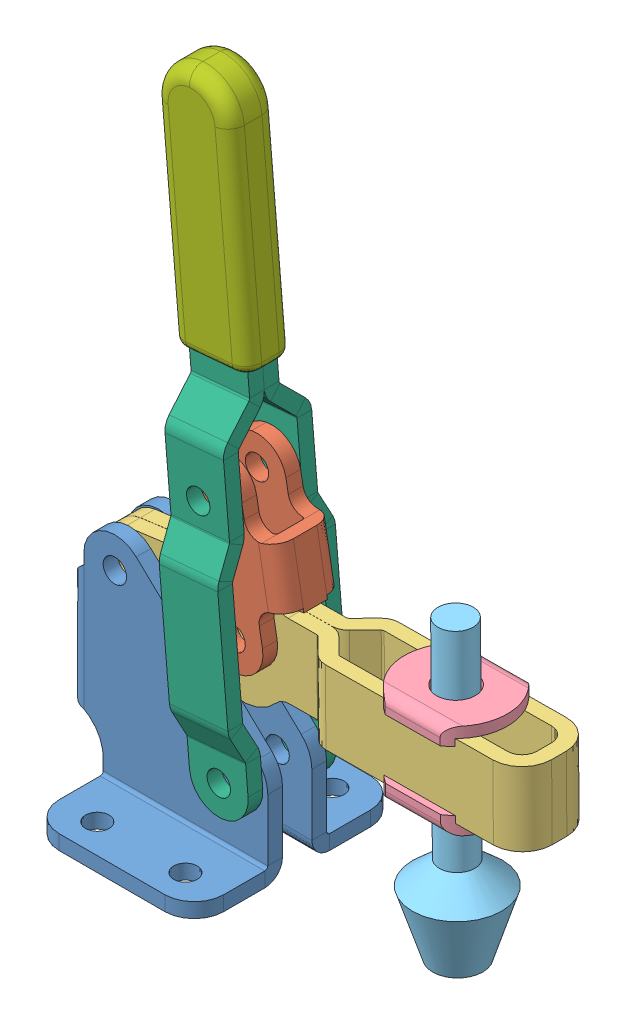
SolidWorks assembly Press Assembly.SLDASM, configuration Default (file format 3100). Lengths in mm.
Overall size (99.88 143.62 44.45).
11 component instances, 7 part files, 10 mates.
Components (placement in the parent):
- Press Base-1: Press Base.SLDPRT [Default] at origin size (42.93 49.25 44.45)
- Linkage Bracket-1: Linkage Bracket.SLDPRT [Default] at (31.0744 67.7503 0) x (0.175613 -0.984459 0) z (0 0 1) size (38.1 19.05 12.7)
- hold-down sub-assy_&-1: hold-down sub-assy_&.SLDASM [Default] at (3.6062 32.9708 -6.35) x (0.99997 0.007797 0) z (0 0 1) size (96.01 63.5 19.3)
  - Press Arm-1: Press Arm.SLDPRT [Default] at origin size (96.01 23.62 15.88)
  - Press Washer-1: Press Washer.SLDPRT [Default] at (73.787 -2.286 0) x (0 0 -1) z (1 0 0) size (18.8 3.81 22.23)
  - Press Washer-2: Press Washer.SLDPRT [Default] at (73.787 18.161 0) x (0 0 -1) z (-1 0 0) size (18.8 3.81 22.23)
  - hold-down bolt_&-1: hold-down bolt_&.sldprt [Default] at (73.787 -32.766 0) size (19.3 63.5 19.3)
- handle sub-assy_&-1: handle sub-assy_&.sldasm [Default] at (6.7062 10.5965 -12.7) x (0.08747 -0.996167 0) z (0 0 1) size (132.59 16.51 25.4)
  - handle-half_&-1: handle-half_&.SLDPRT [Default] at (2.3468 22.924 12.7) size (130.68 12.7 12.7)
  - handle-half_&-2: handle-half_&.SLDPRT [Default] at (2.3468 35.624 0) x (1 0 0) z (0 0 -1) size (130.68 12.7 12.7)
  - Grip sleeve-1: Grip sleeve.sldprt [Default] at (-128.3362 22.924 3.175) size (52.77 16.51 10.16)
Mates (geometry in assembly coordinates):
- MateCoincident15: coincident aligned: plane of Press Base-1; plane of assembly
- MateCoincident16: coincident anti-aligned: plane of Press Base-1; plane of assembly
- MateCoincident17: coincident anti-aligned: plane of Press Base-1; plane of assembly
- MateConcentric10: concentric aligned: cylinder of Press Base-1; cylinder of handle sub-assy_&-1/handle-half_&-1
- MateCoincident20: coincident anti-aligned: plane of Press Base-1; plane of handle sub-assy_&-1/handle-half_&-1
- MateConcentric11: concentric aligned: cylinder of handle sub-assy_&-1/handle-half_&-1; cylinder of Linkage Bracket-1
- MateCoincident21: coincident anti-aligned: plane of handle sub-assy_&-1/handle-half_&-1; plane of Linkage Bracket-1
- Concentric1: concentric aligned: cylinder of Press Base-1; cylinder of hold-down sub-assy_&-1/Press Arm-1
- Coincident1: coincident anti-aligned: plane of Press Base-1; plane of hold-down sub-assy_&-1/Press Arm-1
- Concentric2: concentric aligned: cylinder of hold-down sub-assy_&-1/Press Arm-1; cylinder of Linkage Bracket-1
